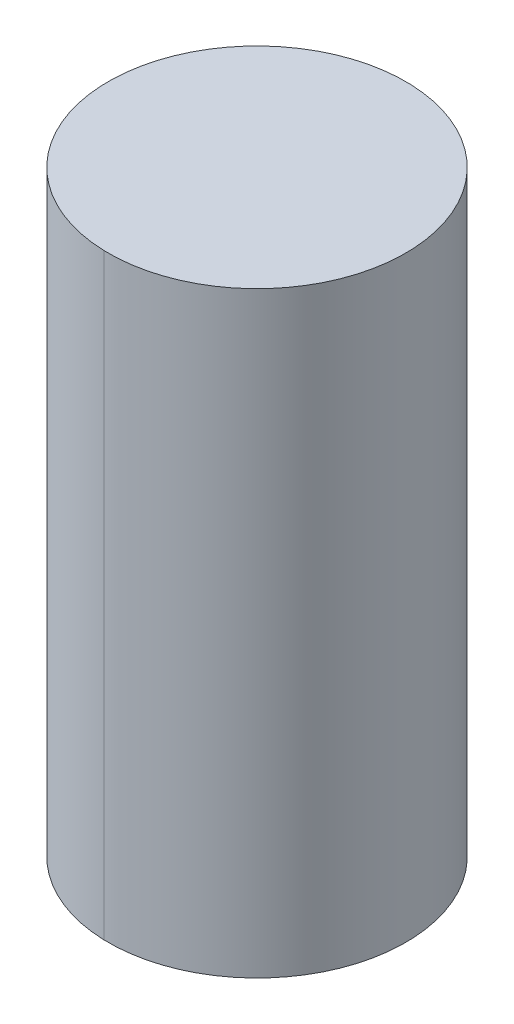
ISO-10303-21;
HEADER;
FILE_DESCRIPTION(('STEP AP214'),'2;1');
FILE_NAME('part.step','',(''),(''),'','','');
FILE_SCHEMA(('AUTOMOTIVE_DESIGN { 1 0 10303 214 1 1 1 1 }'));
ENDSEC;
DATA;
#1=APPLICATION_CONTEXT('core data for automotive mechanical design processes');
#2=APPLICATION_PROTOCOL_DEFINITION('international standard','automotive_design',2000,#1);
#3=PRODUCT_CONTEXT('',#1,'mechanical');
#4=PRODUCT('Part','Part','',(#3));
#5=PRODUCT_RELATED_PRODUCT_CATEGORY('part','',(#4));
#6=PRODUCT_DEFINITION_FORMATION('','',#4);
#7=PRODUCT_DEFINITION_CONTEXT('part definition',#1,'design');
#8=PRODUCT_DEFINITION('design','',#6,#7);
#9=PRODUCT_DEFINITION_SHAPE('','',#8);
#10=(LENGTH_UNIT() NAMED_UNIT(*) SI_UNIT(.MILLI.,.METRE.));
#11=(NAMED_UNIT(*) PLANE_ANGLE_UNIT() SI_UNIT($,.RADIAN.));
#12=(NAMED_UNIT(*) SI_UNIT($,.STERADIAN.) SOLID_ANGLE_UNIT());
#13=UNCERTAINTY_MEASURE_WITH_UNIT(LENGTH_MEASURE(1.E-05),#10,'distance_accuracy_value','');
#14=(GEOMETRIC_REPRESENTATION_CONTEXT(3) GLOBAL_UNCERTAINTY_ASSIGNED_CONTEXT((#13)) GLOBAL_UNIT_ASSIGNED_CONTEXT((#10,
#11,#12)) REPRESENTATION_CONTEXT('',''));
#15=CARTESIAN_POINT('',(0.,0.,0.));
#16=DIRECTION('',(0.,0.,1.));
#17=DIRECTION('',(1.,0.,0.));
#18=AXIS2_PLACEMENT_3D('',#15,#16,#17);
#19=CARTESIAN_POINT('',(13.7198083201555,5.08666666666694,8.17947063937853));
#20=DIRECTION('',(0.,-1.,1.98158045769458E-13));
#21=DIRECTION('',(0.0310044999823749,-1.98184512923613E-13,-0.999519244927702));
#22=AXIS2_PLACEMENT_3D('',#19,#20,#21);
#23=CYLINDRICAL_SURFACE('',#22,1.27);
#24=DIRECTION('',(0.,-1.,1.98158045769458E-13));
#25=VECTOR('',#24,1.);
#26=CARTESIAN_POINT('',(13.7591840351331,1.44999999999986,6.91008119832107));
#27=LINE('',#26,#25);
#28=CARTESIAN_POINT('',(13.7591840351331,3.99999999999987,6.9100811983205));
#29=VERTEX_POINT('',#28);
#30=CARTESIAN_POINT('',(13.759184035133,-1.10000000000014,6.91008119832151));
#31=VERTEX_POINT('',#30);
#32=EDGE_CURVE('E49',#29,#31,#27,.T.);
#33=ORIENTED_EDGE('',*,*,#32,.T.);
#34=CARTESIAN_POINT('',(13.7198083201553,-1.09999999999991,8.17947063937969));
#35=DIRECTION('',(0.,-1.,1.98158045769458E-13));
#36=DIRECTION('',(0.0310044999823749,-1.98184512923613E-13,-0.999519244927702));
#37=AXIS2_PLACEMENT_3D('',#34,#35,#36);
#38=CIRCLE('',#37,1.27);
#39=CARTESIAN_POINT('',(13.6804326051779,-1.09999999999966,9.44886008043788));
#40=VERTEX_POINT('',#39);
#41=EDGE_CURVE('E11',#40,#31,#38,.T.);
#42=ORIENTED_EDGE('',*,*,#41,.F.);
#43=DIRECTION('',(0.,1.,-1.98158045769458E-13));
#44=VECTOR('',#43,1.);
#45=CARTESIAN_POINT('',(13.6804326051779,1.45000000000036,9.44886008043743));
#46=LINE('',#45,#44);
#47=CARTESIAN_POINT('',(13.6804326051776,4.00000000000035,9.44886008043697));
#48=VERTEX_POINT('',#47);
#49=EDGE_CURVE('E51',#40,#48,#46,.T.);
#50=ORIENTED_EDGE('',*,*,#49,.T.);
#51=CARTESIAN_POINT('',(13.7198083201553,4.00000000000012,8.17947063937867));
#52=DIRECTION('',(0.,-1.,1.98324501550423E-13));
#53=DIRECTION('',(0.0310044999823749,-1.98351046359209E-13,-0.999519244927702));
#54=AXIS2_PLACEMENT_3D('',#51,#52,#53);
#55=CIRCLE('',#54,1.27);
#56=EDGE_CURVE('E26',#48,#29,#55,.T.);
#57=ORIENTED_EDGE('',*,*,#56,.T.);
#58=EDGE_LOOP('',(#33,#42,#50,#57));
#59=FACE_BOUND('',#58,.T.);
#60=ADVANCED_FACE('F16',(#59),#23,.T.);
#61=CARTESIAN_POINT('',(13.7198083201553,-1.09999999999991,8.17947063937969));
#62=DIRECTION('',(0.,-1.,1.98158045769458E-13));
#63=DIRECTION('',(-1.,0.,0.));
#64=AXIS2_PLACEMENT_3D('',#61,#62,#63);
#65=PLANE('',#64);
#66=CARTESIAN_POINT('',(13.7198083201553,-1.09999999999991,8.17947063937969));
#67=DIRECTION('',(0.,-1.,1.98158045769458E-13));
#68=DIRECTION('',(0.0310044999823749,-1.98184512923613E-13,-0.999519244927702));
#69=AXIS2_PLACEMENT_3D('',#66,#67,#68);
#70=CIRCLE('',#69,1.27);
#71=EDGE_CURVE('E19',#31,#40,#70,.T.);
#72=ORIENTED_EDGE('',*,*,#71,.T.);
#73=ORIENTED_EDGE('',*,*,#41,.T.);
#74=EDGE_LOOP('',(#72,#73));
#75=FACE_BOUND('',#74,.T.);
#76=ADVANCED_FACE('F72',(#75),#65,.T.);
#77=CARTESIAN_POINT('',(-3.5456742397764,4.00000000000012,7.64390551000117));
#78=DIRECTION('',(0.,1.,-1.98324501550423E-13));
#79=DIRECTION('',(0.,-1.98324501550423E-13,-1.));
#80=AXIS2_PLACEMENT_3D('',#77,#78,#79);
#81=PLANE('',#80);
#82=ORIENTED_EDGE('',*,*,#56,.F.);
#83=CARTESIAN_POINT('',(13.7198083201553,4.00000000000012,8.17947063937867));
#84=DIRECTION('',(0.,-1.,1.98324501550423E-13));
#85=DIRECTION('',(0.0310044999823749,-1.98351046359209E-13,-0.999519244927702));
#86=AXIS2_PLACEMENT_3D('',#83,#84,#85);
#87=CIRCLE('',#86,1.27);
#88=EDGE_CURVE('E56',#29,#48,#87,.T.);
#89=ORIENTED_EDGE('',*,*,#88,.F.);
#90=EDGE_LOOP('',(#82,#89));
#91=FACE_BOUND('',#90,.T.);
#92=ADVANCED_FACE('F57',(#91),#81,.T.);
#93=CARTESIAN_POINT('',(13.7198083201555,5.08666666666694,8.17947063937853));
#94=DIRECTION('',(0.,-1.,1.98158045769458E-13));
#95=DIRECTION('',(0.0310044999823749,-1.98184512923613E-13,-0.999519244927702));
#96=AXIS2_PLACEMENT_3D('',#93,#94,#95);
#97=CYLINDRICAL_SURFACE('',#96,1.27);
#98=ORIENTED_EDGE('',*,*,#32,.F.);
#99=ORIENTED_EDGE('',*,*,#88,.T.);
#100=ORIENTED_EDGE('',*,*,#49,.F.);
#101=ORIENTED_EDGE('',*,*,#71,.F.);
#102=EDGE_LOOP('',(#98,#99,#100,#101));
#103=FACE_BOUND('',#102,.T.);
#104=ADVANCED_FACE('F62',(#103),#97,.T.);
#105=CLOSED_SHELL('',(#60,#76,#92,#104));
#106=MANIFOLD_SOLID_BREP('B1',#105);
#107=ADVANCED_BREP_SHAPE_REPRESENTATION('',(#18,#106),#14);
#108=SHAPE_DEFINITION_REPRESENTATION(#9,#107);
ENDSEC;
END-ISO-10303-21;
